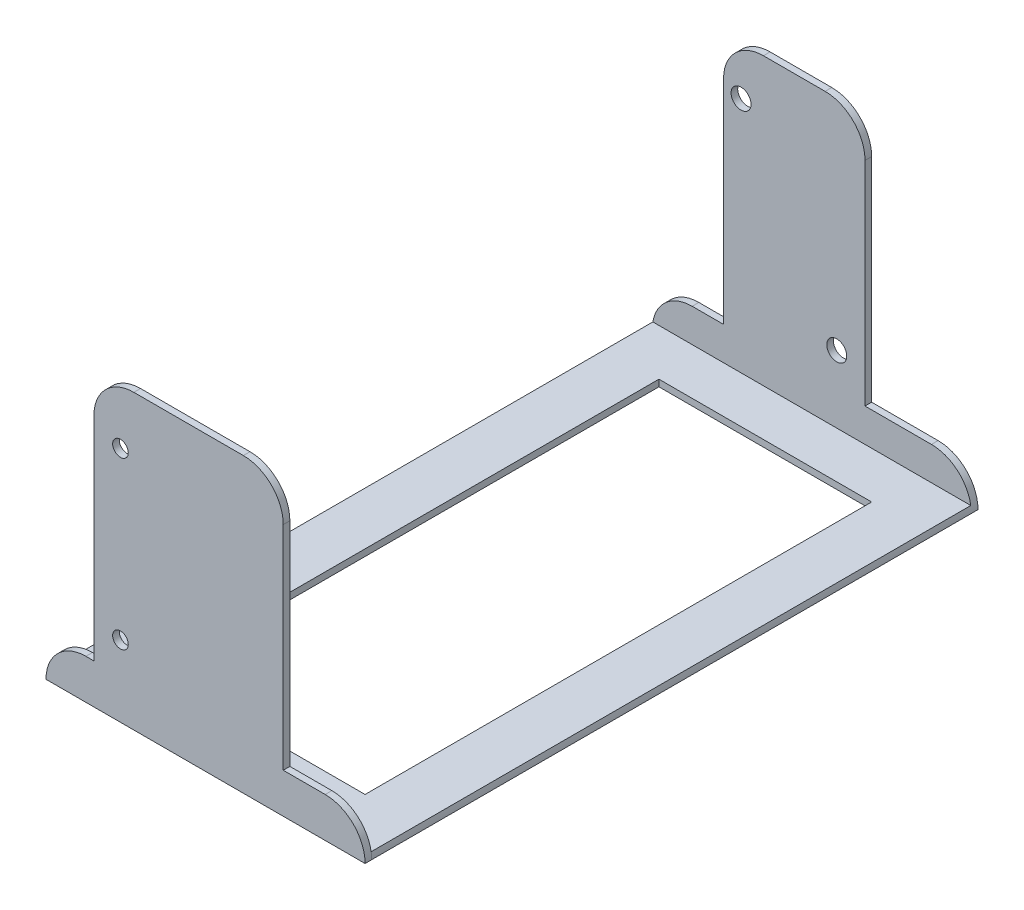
ISO-10303-21;
HEADER;
FILE_DESCRIPTION(('STEP AP214'),'2;1');
FILE_NAME('part.step','',(''),(''),'','','');
FILE_SCHEMA(('AUTOMOTIVE_DESIGN { 1 0 10303 214 1 1 1 1 }'));
ENDSEC;
DATA;
#1=APPLICATION_CONTEXT('core data for automotive mechanical design processes');
#2=APPLICATION_PROTOCOL_DEFINITION('international standard','automotive_design',2000,#1);
#3=PRODUCT_CONTEXT('',#1,'mechanical');
#4=PRODUCT('Part','Part','',(#3));
#5=PRODUCT_RELATED_PRODUCT_CATEGORY('part','',(#4));
#6=PRODUCT_DEFINITION_FORMATION('','',#4);
#7=PRODUCT_DEFINITION_CONTEXT('part definition',#1,'design');
#8=PRODUCT_DEFINITION('design','',#6,#7);
#9=PRODUCT_DEFINITION_SHAPE('','',#8);
#10=(LENGTH_UNIT() NAMED_UNIT(*) SI_UNIT(.MILLI.,.METRE.));
#11=(NAMED_UNIT(*) PLANE_ANGLE_UNIT() SI_UNIT($,.RADIAN.));
#12=(NAMED_UNIT(*) SI_UNIT($,.STERADIAN.) SOLID_ANGLE_UNIT());
#13=UNCERTAINTY_MEASURE_WITH_UNIT(LENGTH_MEASURE(1.E-05),#10,'distance_accuracy_value','');
#14=(GEOMETRIC_REPRESENTATION_CONTEXT(3) GLOBAL_UNCERTAINTY_ASSIGNED_CONTEXT((#13)) GLOBAL_UNIT_ASSIGNED_CONTEXT((#10,
#11,#12)) REPRESENTATION_CONTEXT('',''));
#15=CARTESIAN_POINT('',(0.,0.,0.));
#16=DIRECTION('',(0.,0.,1.));
#17=DIRECTION('',(1.,0.,0.));
#18=AXIS2_PLACEMENT_3D('',#15,#16,#17);
#19=CARTESIAN_POINT('',(76.2,0.,-146.3802));
#20=DIRECTION('',(0.,1.,0.));
#21=DIRECTION('',(0.,0.,1.));
#22=AXIS2_PLACEMENT_3D('',#19,#20,#21);
#23=PLANE('',#22);
#24=DIRECTION('',(1.,0.,0.));
#25=VECTOR('',#24,1.);
#26=CARTESIAN_POINT('',(12.7,0.,-133.6802));
#27=LINE('',#26,#25);
#28=CARTESIAN_POINT('',(12.7,0.,-133.6802));
#29=VERTEX_POINT('',#28);
#30=CARTESIAN_POINT('',(63.5,0.,-133.6802));
#31=VERTEX_POINT('',#30);
#32=EDGE_CURVE('E281',#29,#31,#27,.T.);
#33=ORIENTED_EDGE('',*,*,#32,.F.);
#34=DIRECTION('',(0.,0.,-1.));
#35=VECTOR('',#34,1.);
#36=CARTESIAN_POINT('',(12.7,0.,-12.7));
#37=LINE('',#36,#35);
#38=CARTESIAN_POINT('',(12.7,0.,-12.7));
#39=VERTEX_POINT('',#38);
#40=EDGE_CURVE('E279',#39,#29,#37,.T.);
#41=ORIENTED_EDGE('',*,*,#40,.F.);
#42=DIRECTION('',(-1.,0.,0.));
#43=VECTOR('',#42,1.);
#44=CARTESIAN_POINT('',(12.7,0.,-12.7));
#45=LINE('',#44,#43);
#46=CARTESIAN_POINT('',(63.5,0.,-12.7));
#47=VERTEX_POINT('',#46);
#48=EDGE_CURVE('E287',#47,#39,#45,.T.);
#49=ORIENTED_EDGE('',*,*,#48,.F.);
#50=DIRECTION('',(0.,0.,1.));
#51=VECTOR('',#50,1.);
#52=CARTESIAN_POINT('',(63.5,0.,-12.7));
#53=LINE('',#52,#51);
#54=EDGE_CURVE('E284',#31,#47,#53,.T.);
#55=ORIENTED_EDGE('',*,*,#54,.F.);
#56=EDGE_LOOP('',(#33,#41,#49,#55));
#57=FACE_BOUND('',#56,.T.);
#58=DIRECTION('',(0.,0.,-1.));
#59=VECTOR('',#58,1.);
#60=CARTESIAN_POINT('',(0.,0.,-146.3802));
#61=LINE('',#60,#59);
#62=CARTESIAN_POINT('',(0.,0.,0.));
#63=VERTEX_POINT('',#62);
#64=CARTESIAN_POINT('',(0.,0.,-1.58749999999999));
#65=VERTEX_POINT('',#64);
#66=EDGE_CURVE('E332',#63,#65,#61,.T.);
#67=ORIENTED_EDGE('',*,*,#66,.T.);
#68=CARTESIAN_POINT('',(0.,0.,-146.3802));
#69=VERTEX_POINT('',#68);
#70=EDGE_CURVE('E326',#65,#69,#61,.T.);
#71=ORIENTED_EDGE('',*,*,#70,.T.);
#72=DIRECTION('',(-1.,0.,0.));
#73=VECTOR('',#72,1.);
#74=CARTESIAN_POINT('',(76.2,0.,-146.3802));
#75=LINE('',#74,#73);
#76=CARTESIAN_POINT('',(76.2,0.,-146.3802));
#77=VERTEX_POINT('',#76);
#78=EDGE_CURVE('E353',#77,#69,#75,.T.);
#79=ORIENTED_EDGE('',*,*,#78,.F.);
#80=DIRECTION('',(0.,0.,-1.));
#81=VECTOR('',#80,1.);
#82=CARTESIAN_POINT('',(76.2,0.,-146.3802));
#83=LINE('',#82,#81);
#84=CARTESIAN_POINT('',(76.2,0.,-1.58749999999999));
#85=VERTEX_POINT('',#84);
#86=EDGE_CURVE('E331',#85,#77,#83,.T.);
#87=ORIENTED_EDGE('',*,*,#86,.F.);
#88=CARTESIAN_POINT('',(76.2,0.,0.));
#89=VERTEX_POINT('',#88);
#90=EDGE_CURVE('E327',#89,#85,#83,.T.);
#91=ORIENTED_EDGE('',*,*,#90,.F.);
#92=DIRECTION('',(-1.,0.,0.));
#93=VECTOR('',#92,1.);
#94=CARTESIAN_POINT('',(76.2,0.,0.));
#95=LINE('',#94,#93);
#96=EDGE_CURVE('E330',#89,#63,#95,.T.);
#97=ORIENTED_EDGE('',*,*,#96,.T.);
#98=EDGE_LOOP('',(#67,#71,#79,#87,#91,#97));
#99=FACE_BOUND('',#98,.T.);
#100=ADVANCED_FACE('F37',(#57,#99),#23,.F.);
#101=CARTESIAN_POINT('',(76.2,69.85,-146.3802));
#102=DIRECTION('',(0.,0.,1.));
#103=DIRECTION('',(0.,-1.,0.));
#104=AXIS2_PLACEMENT_3D('',#101,#102,#103);
#105=PLANE('',#104);
#106=CARTESIAN_POINT('',(21.1963,58.3057,-146.3802));
#107=DIRECTION('',(0.,0.,1.));
#108=DIRECTION('',(0.,-1.,0.));
#109=AXIS2_PLACEMENT_3D('',#106,#107,#108);
#110=CIRCLE('',#109,2.38125);
#111=CARTESIAN_POINT('',(21.1963,55.92445,-146.3802));
#112=VERTEX_POINT('',#111);
#113=EDGE_CURVE('E305',#112,#112,#110,.F.);
#114=ORIENTED_EDGE('',*,*,#113,.F.);
#115=EDGE_LOOP('',(#114));
#116=FACE_BOUND('',#115,.T.);
#117=CARTESIAN_POINT('',(44.0563,17.6657,-146.3802));
#118=DIRECTION('',(0.,0.,1.));
#119=DIRECTION('',(0.,-1.,0.));
#120=AXIS2_PLACEMENT_3D('',#117,#118,#119);
#121=CIRCLE('',#120,2.38125);
#122=CARTESIAN_POINT('',(44.0563,15.28445,-146.3802));
#123=VERTEX_POINT('',#122);
#124=EDGE_CURVE('E311',#123,#123,#121,.F.);
#125=ORIENTED_EDGE('',*,*,#124,.F.);
#126=EDGE_LOOP('',(#125));
#127=FACE_BOUND('',#126,.T.);
#128=ORIENTED_EDGE('',*,*,#78,.T.);
#129=CARTESIAN_POINT('',(9.525,0.,-146.3802));
#130=DIRECTION('',(0.,0.,1.));
#131=DIRECTION('',(0.,-1.,0.));
#132=AXIS2_PLACEMENT_3D('',#129,#130,#131);
#133=CIRCLE('',#132,9.525);
#134=CARTESIAN_POINT('',(9.525,9.52500000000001,-146.3802));
#135=VERTEX_POINT('',#134);
#136=EDGE_CURVE('E362',#69,#135,#133,.F.);
#137=ORIENTED_EDGE('',*,*,#136,.T.);
#138=DIRECTION('',(-1.,0.,0.));
#139=VECTOR('',#138,1.);
#140=CARTESIAN_POINT('',(0.,9.52500000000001,-146.3802));
#141=LINE('',#140,#139);
#142=CARTESIAN_POINT('',(17.018,9.52500000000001,-146.3802));
#143=VERTEX_POINT('',#142);
#144=EDGE_CURVE('E249',#143,#135,#141,.T.);
#145=ORIENTED_EDGE('',*,*,#144,.F.);
#146=DIRECTION('',(0.,-1.,0.));
#147=VECTOR('',#146,1.);
#148=CARTESIAN_POINT('',(17.018,69.85,-146.3802));
#149=LINE('',#148,#147);
#150=CARTESIAN_POINT('',(17.018,60.325,-146.3802));
#151=VERTEX_POINT('',#150);
#152=EDGE_CURVE('E252',#151,#143,#149,.T.);
#153=ORIENTED_EDGE('',*,*,#152,.F.);
#154=CARTESIAN_POINT('',(26.543,60.325,-146.3802));
#155=DIRECTION('',(0.,0.,1.));
#156=DIRECTION('',(0.,-1.,0.));
#157=AXIS2_PLACEMENT_3D('',#154,#155,#156);
#158=CIRCLE('',#157,9.525);
#159=CARTESIAN_POINT('',(26.543,69.85,-146.3802));
#160=VERTEX_POINT('',#159);
#161=EDGE_CURVE('E360',#151,#160,#158,.F.);
#162=ORIENTED_EDGE('',*,*,#161,.T.);
#163=DIRECTION('',(-1.,0.,0.));
#164=VECTOR('',#163,1.);
#165=CARTESIAN_POINT('',(76.2,69.85,-146.3802));
#166=LINE('',#165,#164);
#167=CARTESIAN_POINT('',(41.275,69.85,-146.3802));
#168=VERTEX_POINT('',#167);
#169=EDGE_CURVE('E350',#168,#160,#166,.T.);
#170=ORIENTED_EDGE('',*,*,#169,.F.);
#171=CARTESIAN_POINT('',(41.275,60.325,-146.3802));
#172=DIRECTION('',(0.,0.,1.));
#173=DIRECTION('',(0.,-1.,0.));
#174=AXIS2_PLACEMENT_3D('',#171,#172,#173);
#175=CIRCLE('',#174,9.525);
#176=CARTESIAN_POINT('',(50.8,60.325,-146.3802));
#177=VERTEX_POINT('',#176);
#178=EDGE_CURVE('E358',#168,#177,#175,.F.);
#179=ORIENTED_EDGE('',*,*,#178,.T.);
#180=DIRECTION('',(0.,1.,0.));
#181=VECTOR('',#180,1.);
#182=CARTESIAN_POINT('',(50.8,69.85,-146.3802));
#183=LINE('',#182,#181);
#184=CARTESIAN_POINT('',(50.8,9.52500000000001,-146.3802));
#185=VERTEX_POINT('',#184);
#186=EDGE_CURVE('E262',#185,#177,#183,.T.);
#187=ORIENTED_EDGE('',*,*,#186,.F.);
#188=DIRECTION('',(-1.,0.,0.));
#189=VECTOR('',#188,1.);
#190=CARTESIAN_POINT('',(76.2,9.52500000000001,-146.3802));
#191=LINE('',#190,#189);
#192=CARTESIAN_POINT('',(66.675,9.52500000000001,-146.3802));
#193=VERTEX_POINT('',#192);
#194=EDGE_CURVE('E259',#193,#185,#191,.T.);
#195=ORIENTED_EDGE('',*,*,#194,.F.);
#196=CARTESIAN_POINT('',(66.675,0.,-146.3802));
#197=DIRECTION('',(0.,0.,1.));
#198=DIRECTION('',(0.,-1.,0.));
#199=AXIS2_PLACEMENT_3D('',#196,#197,#198);
#200=CIRCLE('',#199,9.525);
#201=EDGE_CURVE('E356',#193,#77,#200,.F.);
#202=ORIENTED_EDGE('',*,*,#201,.T.);
#203=EDGE_LOOP('',(#128,#137,#145,#153,#162,#170,#179,#187,#195,#202));
#204=FACE_BOUND('',#203,.T.);
#205=ADVANCED_FACE('F468',(#116,#127,#204),#105,.F.);
#206=CARTESIAN_POINT('',(76.2,69.85,-144.7927));
#207=DIRECTION('',(0.,-1.,0.));
#208=DIRECTION('',(0.,0.,-1.));
#209=AXIS2_PLACEMENT_3D('',#206,#207,#208);
#210=PLANE('',#209);
#211=ORIENTED_EDGE('',*,*,#169,.T.);
#212=DIRECTION('',(0.,0.,-1.));
#213=VECTOR('',#212,1.);
#214=CARTESIAN_POINT('',(26.543,69.85,-144.7927));
#215=LINE('',#214,#213);
#216=CARTESIAN_POINT('',(26.543,69.85,-144.7927));
#217=VERTEX_POINT('',#216);
#218=EDGE_CURVE('E384',#160,#217,#215,.F.);
#219=ORIENTED_EDGE('',*,*,#218,.T.);
#220=DIRECTION('',(-1.,0.,0.));
#221=VECTOR('',#220,1.);
#222=CARTESIAN_POINT('',(76.2,69.85,-144.7927));
#223=LINE('',#222,#221);
#224=CARTESIAN_POINT('',(41.275,69.85,-144.7927));
#225=VERTEX_POINT('',#224);
#226=EDGE_CURVE('E347',#225,#217,#223,.T.);
#227=ORIENTED_EDGE('',*,*,#226,.F.);
#228=DIRECTION('',(0.,0.,-1.));
#229=VECTOR('',#228,1.);
#230=CARTESIAN_POINT('',(41.275,69.85,-144.7927));
#231=LINE('',#230,#229);
#232=EDGE_CURVE('E381',#225,#168,#231,.T.);
#233=ORIENTED_EDGE('',*,*,#232,.T.);
#234=EDGE_LOOP('',(#211,#219,#227,#233));
#235=FACE_BOUND('',#234,.T.);
#236=ADVANCED_FACE('F476',(#235),#210,.F.);
#237=CARTESIAN_POINT('',(76.2,1.58749999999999,-144.7927));
#238=DIRECTION('',(0.,0.,-1.));
#239=DIRECTION('',(0.,1.,0.));
#240=AXIS2_PLACEMENT_3D('',#237,#238,#239);
#241=PLANE('',#240);
#242=CARTESIAN_POINT('',(21.1963,58.3057,-144.7927));
#243=DIRECTION('',(0.,0.,1.));
#244=DIRECTION('',(1.,0.,0.));
#245=AXIS2_PLACEMENT_3D('',#242,#243,#244);
#246=CIRCLE('',#245,2.38125);
#247=CARTESIAN_POINT('',(23.57755,58.3057,-144.7927));
#248=VERTEX_POINT('',#247);
#249=EDGE_CURVE('E302',#248,#248,#246,.T.);
#250=ORIENTED_EDGE('',*,*,#249,.F.);
#251=EDGE_LOOP('',(#250));
#252=FACE_BOUND('',#251,.T.);
#253=CARTESIAN_POINT('',(44.0563,17.6657,-144.7927));
#254=DIRECTION('',(0.,0.,1.));
#255=DIRECTION('',(1.,0.,0.));
#256=AXIS2_PLACEMENT_3D('',#253,#254,#255);
#257=CIRCLE('',#256,2.38125);
#258=CARTESIAN_POINT('',(46.43755,17.6657,-144.7927));
#259=VERTEX_POINT('',#258);
#260=EDGE_CURVE('E308',#259,#259,#257,.T.);
#261=ORIENTED_EDGE('',*,*,#260,.F.);
#262=EDGE_LOOP('',(#261));
#263=FACE_BOUND('',#262,.T.);
#264=DIRECTION('',(1.,0.,0.));
#265=VECTOR('',#264,1.);
#266=CARTESIAN_POINT('',(0.,9.52500000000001,-144.7927));
#267=LINE('',#266,#265);
#268=CARTESIAN_POINT('',(9.525,9.52500000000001,-144.7927));
#269=VERTEX_POINT('',#268);
#270=CARTESIAN_POINT('',(17.018,9.52500000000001,-144.7927));
#271=VERTEX_POINT('',#270);
#272=EDGE_CURVE('E246',#269,#271,#267,.T.);
#273=ORIENTED_EDGE('',*,*,#272,.F.);
#274=CARTESIAN_POINT('',(9.525,0.,-144.7927));
#275=DIRECTION('',(0.,0.,-1.));
#276=DIRECTION('',(0.,1.,0.));
#277=AXIS2_PLACEMENT_3D('',#274,#275,#276);
#278=CIRCLE('',#277,9.525);
#279=CARTESIAN_POINT('',(0.1332233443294,1.58749999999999,-144.7927));
#280=VERTEX_POINT('',#279);
#281=EDGE_CURVE('E372',#269,#280,#278,.F.);
#282=ORIENTED_EDGE('',*,*,#281,.T.);
#283=DIRECTION('',(-1.,0.,0.));
#284=VECTOR('',#283,1.);
#285=CARTESIAN_POINT('',(76.2,1.58749999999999,-144.7927));
#286=LINE('',#285,#284);
#287=CARTESIAN_POINT('',(76.0667766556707,1.58749999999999,-144.7927));
#288=VERTEX_POINT('',#287);
#289=EDGE_CURVE('E344',#288,#280,#286,.T.);
#290=ORIENTED_EDGE('',*,*,#289,.F.);
#291=CARTESIAN_POINT('',(66.675,0.,-144.7927));
#292=DIRECTION('',(0.,0.,-1.));
#293=DIRECTION('',(0.,1.,0.));
#294=AXIS2_PLACEMENT_3D('',#291,#292,#293);
#295=CIRCLE('',#294,9.525);
#296=CARTESIAN_POINT('',(66.675,9.52500000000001,-144.7927));
#297=VERTEX_POINT('',#296);
#298=EDGE_CURVE('E366',#288,#297,#295,.F.);
#299=ORIENTED_EDGE('',*,*,#298,.T.);
#300=DIRECTION('',(1.,0.,0.));
#301=VECTOR('',#300,1.);
#302=CARTESIAN_POINT('',(76.2,9.52500000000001,-144.7927));
#303=LINE('',#302,#301);
#304=CARTESIAN_POINT('',(50.8,9.52500000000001,-144.7927));
#305=VERTEX_POINT('',#304);
#306=EDGE_CURVE('E266',#305,#297,#303,.T.);
#307=ORIENTED_EDGE('',*,*,#306,.F.);
#308=DIRECTION('',(0.,-1.,0.));
#309=VECTOR('',#308,1.);
#310=CARTESIAN_POINT('',(50.8,69.8499999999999,-144.7927));
#311=LINE('',#310,#309);
#312=CARTESIAN_POINT('',(50.8,60.325,-144.7927));
#313=VERTEX_POINT('',#312);
#314=EDGE_CURVE('E261',#313,#305,#311,.T.);
#315=ORIENTED_EDGE('',*,*,#314,.F.);
#316=CARTESIAN_POINT('',(41.275,60.325,-144.7927));
#317=DIRECTION('',(0.,0.,-1.));
#318=DIRECTION('',(0.,1.,0.));
#319=AXIS2_PLACEMENT_3D('',#316,#317,#318);
#320=CIRCLE('',#319,9.525);
#321=EDGE_CURVE('E368',#313,#225,#320,.F.);
#322=ORIENTED_EDGE('',*,*,#321,.T.);
#323=ORIENTED_EDGE('',*,*,#226,.T.);
#324=CARTESIAN_POINT('',(26.543,60.325,-144.7927));
#325=DIRECTION('',(0.,0.,-1.));
#326=DIRECTION('',(0.,1.,0.));
#327=AXIS2_PLACEMENT_3D('',#324,#325,#326);
#328=CIRCLE('',#327,9.525);
#329=CARTESIAN_POINT('',(17.018,60.325,-144.7927));
#330=VERTEX_POINT('',#329);
#331=EDGE_CURVE('E370',#217,#330,#328,.F.);
#332=ORIENTED_EDGE('',*,*,#331,.T.);
#333=DIRECTION('',(0.,1.,0.));
#334=VECTOR('',#333,1.);
#335=CARTESIAN_POINT('',(17.018,69.8499999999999,-144.7927));
#336=LINE('',#335,#334);
#337=EDGE_CURVE('E248',#271,#330,#336,.T.);
#338=ORIENTED_EDGE('',*,*,#337,.F.);
#339=EDGE_LOOP('',(#273,#282,#290,#299,#307,#315,#322,#323,#332,#338));
#340=FACE_BOUND('',#339,.T.);
#341=ADVANCED_FACE('F457',(#252,#263,#340),#241,.F.);
#342=CARTESIAN_POINT('',(76.2,1.58749999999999,-1.5875));
#343=DIRECTION('',(0.,-1.,0.));
#344=DIRECTION('',(0.,0.,-1.));
#345=AXIS2_PLACEMENT_3D('',#342,#343,#344);
#346=PLANE('',#345);
#347=DIRECTION('',(1.,0.,0.));
#348=VECTOR('',#347,1.);
#349=CARTESIAN_POINT('',(12.7,1.58749999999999,-12.7));
#350=LINE('',#349,#348);
#351=CARTESIAN_POINT('',(12.7,1.58749999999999,-12.7));
#352=VERTEX_POINT('',#351);
#353=CARTESIAN_POINT('',(63.5,1.58749999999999,-12.7));
#354=VERTEX_POINT('',#353);
#355=EDGE_CURVE('E273',#352,#354,#350,.T.);
#356=ORIENTED_EDGE('',*,*,#355,.F.);
#357=DIRECTION('',(0.,0.,1.));
#358=VECTOR('',#357,1.);
#359=CARTESIAN_POINT('',(12.7,1.58749999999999,-12.7));
#360=LINE('',#359,#358);
#361=CARTESIAN_POINT('',(12.7,1.58749999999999,-133.6802));
#362=VERTEX_POINT('',#361);
#363=EDGE_CURVE('E276',#362,#352,#360,.T.);
#364=ORIENTED_EDGE('',*,*,#363,.F.);
#365=DIRECTION('',(-1.,0.,0.));
#366=VECTOR('',#365,1.);
#367=CARTESIAN_POINT('',(12.7,1.58749999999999,-133.6802));
#368=LINE('',#367,#366);
#369=CARTESIAN_POINT('',(63.5,1.58749999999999,-133.6802));
#370=VERTEX_POINT('',#369);
#371=EDGE_CURVE('E293',#370,#362,#368,.T.);
#372=ORIENTED_EDGE('',*,*,#371,.F.);
#373=DIRECTION('',(0.,0.,-1.));
#374=VECTOR('',#373,1.);
#375=CARTESIAN_POINT('',(63.5,1.58749999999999,-12.7));
#376=LINE('',#375,#374);
#377=EDGE_CURVE('E269',#354,#370,#376,.T.);
#378=ORIENTED_EDGE('',*,*,#377,.F.);
#379=EDGE_LOOP('',(#356,#364,#372,#378));
#380=FACE_BOUND('',#379,.T.);
#381=ORIENTED_EDGE('',*,*,#289,.T.);
#382=DIRECTION('',(0.,0.,1.));
#383=VECTOR('',#382,1.);
#384=CARTESIAN_POINT('',(0.133223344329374,1.58749999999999,-144.7927));
#385=LINE('',#384,#383);
#386=CARTESIAN_POINT('',(0.1332233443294,1.58749999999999,-1.5875));
#387=VERTEX_POINT('',#386);
#388=EDGE_CURVE('E376',#280,#387,#385,.T.);
#389=ORIENTED_EDGE('',*,*,#388,.T.);
#390=DIRECTION('',(-1.,0.,0.));
#391=VECTOR('',#390,1.);
#392=CARTESIAN_POINT('',(76.2,1.58749999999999,-1.5875));
#393=LINE('',#392,#391);
#394=CARTESIAN_POINT('',(76.0667766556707,1.58749999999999,-1.5875));
#395=VERTEX_POINT('',#394);
#396=EDGE_CURVE('E342',#395,#387,#393,.T.);
#397=ORIENTED_EDGE('',*,*,#396,.F.);
#398=DIRECTION('',(0.,0.,-1.));
#399=VECTOR('',#398,1.);
#400=CARTESIAN_POINT('',(76.0667766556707,1.58749999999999,-1.5875));
#401=LINE('',#400,#399);
#402=EDGE_CURVE('E374',#395,#288,#401,.T.);
#403=ORIENTED_EDGE('',*,*,#402,.T.);
#404=EDGE_LOOP('',(#381,#389,#397,#403));
#405=FACE_BOUND('',#404,.T.);
#406=ADVANCED_FACE('F446',(#380,#405),#346,.F.);
#407=CARTESIAN_POINT('',(76.2,69.85,-1.5875));
#408=DIRECTION('',(0.,0.,1.));
#409=DIRECTION('',(0.,-1.,0.));
#410=AXIS2_PLACEMENT_3D('',#407,#408,#409);
#411=PLANE('',#410);
#412=CARTESIAN_POINT('',(17.78,56.6674,-1.58749999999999));
#413=DIRECTION('',(0.,0.,1.));
#414=DIRECTION('',(0.,-1.,0.));
#415=AXIS2_PLACEMENT_3D('',#412,#413,#414);
#416=CIRCLE('',#415,1.8669);
#417=CARTESIAN_POINT('',(17.78,54.8005,-1.58749999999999));
#418=VERTEX_POINT('',#417);
#419=EDGE_CURVE('E314',#418,#418,#416,.F.);
#420=ORIENTED_EDGE('',*,*,#419,.F.);
#421=EDGE_LOOP('',(#420));
#422=FACE_BOUND('',#421,.T.);
#423=CARTESIAN_POINT('',(17.78,17.0434,-1.58749999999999));
#424=DIRECTION('',(0.,0.,1.));
#425=DIRECTION('',(0.,-1.,0.));
#426=AXIS2_PLACEMENT_3D('',#423,#424,#425);
#427=CIRCLE('',#426,1.8669);
#428=CARTESIAN_POINT('',(17.78,15.1765,-1.58749999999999));
#429=VERTEX_POINT('',#428);
#430=EDGE_CURVE('E320',#429,#429,#427,.F.);
#431=ORIENTED_EDGE('',*,*,#430,.F.);
#432=EDGE_LOOP('',(#431));
#433=FACE_BOUND('',#432,.T.);
#434=DIRECTION('',(-1.,0.,0.));
#435=VECTOR('',#434,1.);
#436=CARTESIAN_POINT('',(76.2,69.85,-1.5875));
#437=LINE('',#436,#435);
#438=CARTESIAN_POINT('',(47.1297,69.85,-1.5875));
#439=VERTEX_POINT('',#438);
#440=CARTESIAN_POINT('',(20.9804,69.85,-1.5875));
#441=VERTEX_POINT('',#440);
#442=EDGE_CURVE('E339',#439,#441,#437,.T.);
#443=ORIENTED_EDGE('',*,*,#442,.F.);
#444=CARTESIAN_POINT('',(47.1297,60.325,-1.58749999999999));
#445=DIRECTION('',(0.,0.,1.));
#446=DIRECTION('',(0.,-1.,0.));
#447=AXIS2_PLACEMENT_3D('',#444,#445,#446);
#448=CIRCLE('',#447,9.525);
#449=CARTESIAN_POINT('',(56.6547,60.325,-1.58749999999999));
#450=VERTEX_POINT('',#449);
#451=EDGE_CURVE('E230',#439,#450,#448,.F.);
#452=ORIENTED_EDGE('',*,*,#451,.T.);
#453=DIRECTION('',(0.,1.,0.));
#454=VECTOR('',#453,1.);
#455=CARTESIAN_POINT('',(56.6547,69.85,-1.58749999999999));
#456=LINE('',#455,#454);
#457=CARTESIAN_POINT('',(56.6547,9.525,-1.58749999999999));
#458=VERTEX_POINT('',#457);
#459=EDGE_CURVE('E221',#458,#450,#456,.T.);
#460=ORIENTED_EDGE('',*,*,#459,.F.);
#461=DIRECTION('',(-1.,0.,0.));
#462=VECTOR('',#461,1.);
#463=CARTESIAN_POINT('',(76.2,9.525,-1.58749999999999));
#464=LINE('',#463,#462);
#465=CARTESIAN_POINT('',(66.675,9.525,-1.58749999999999));
#466=VERTEX_POINT('',#465);
#467=EDGE_CURVE('E206',#466,#458,#464,.T.);
#468=ORIENTED_EDGE('',*,*,#467,.F.);
#469=CARTESIAN_POINT('',(66.675,0.,-1.5875));
#470=DIRECTION('',(0.,0.,1.));
#471=DIRECTION('',(0.,-1.,0.));
#472=AXIS2_PLACEMENT_3D('',#469,#470,#471);
#473=CIRCLE('',#472,9.525);
#474=EDGE_CURVE('E412',#466,#395,#473,.F.);
#475=ORIENTED_EDGE('',*,*,#474,.T.);
#476=ORIENTED_EDGE('',*,*,#396,.T.);
#477=CARTESIAN_POINT('',(9.525,0.,-1.58749999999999));
#478=DIRECTION('',(0.,0.,1.));
#479=DIRECTION('',(0.,-1.,0.));
#480=AXIS2_PLACEMENT_3D('',#477,#478,#479);
#481=CIRCLE('',#480,9.525);
#482=CARTESIAN_POINT('',(9.525,9.525,-1.58749999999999));
#483=VERTEX_POINT('',#482);
#484=EDGE_CURVE('E60',#387,#483,#481,.F.);
#485=ORIENTED_EDGE('',*,*,#484,.T.);
#486=DIRECTION('',(-1.,0.,0.));
#487=VECTOR('',#486,1.);
#488=CARTESIAN_POINT('',(0.,9.525,-1.58749999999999));
#489=LINE('',#488,#487);
#490=CARTESIAN_POINT('',(11.4554,9.525,-1.58749999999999));
#491=VERTEX_POINT('',#490);
#492=EDGE_CURVE('E215',#491,#483,#489,.T.);
#493=ORIENTED_EDGE('',*,*,#492,.F.);
#494=DIRECTION('',(0.,-1.,0.));
#495=VECTOR('',#494,1.);
#496=CARTESIAN_POINT('',(11.4554,69.85,-1.58749999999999));
#497=LINE('',#496,#495);
#498=CARTESIAN_POINT('',(11.4554,60.325,-1.58749999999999));
#499=VERTEX_POINT('',#498);
#500=EDGE_CURVE('E236',#499,#491,#497,.T.);
#501=ORIENTED_EDGE('',*,*,#500,.F.);
#502=CARTESIAN_POINT('',(20.9804,60.325,-1.5875));
#503=DIRECTION('',(0.,0.,1.));
#504=DIRECTION('',(0.,-1.,0.));
#505=AXIS2_PLACEMENT_3D('',#502,#503,#504);
#506=CIRCLE('',#505,9.525);
#507=EDGE_CURVE('E415',#499,#441,#506,.F.);
#508=ORIENTED_EDGE('',*,*,#507,.T.);
#509=EDGE_LOOP('',(#443,#452,#460,#468,#475,#476,#485,#493,#501,#508));
#510=FACE_BOUND('',#509,.T.);
#511=ADVANCED_FACE('F228',(#422,#433,#510),#411,.F.);
#512=CARTESIAN_POINT('',(76.2,69.85,0.));
#513=DIRECTION('',(0.,-1.,0.));
#514=DIRECTION('',(0.,0.,-1.));
#515=AXIS2_PLACEMENT_3D('',#512,#513,#514);
#516=PLANE('',#515);
#517=DIRECTION('',(-1.,0.,0.));
#518=VECTOR('',#517,1.);
#519=CARTESIAN_POINT('',(76.2,69.85,0.));
#520=LINE('',#519,#518);
#521=CARTESIAN_POINT('',(47.1297,69.85,0.));
#522=VERTEX_POINT('',#521);
#523=CARTESIAN_POINT('',(20.9804,69.85,0.));
#524=VERTEX_POINT('',#523);
#525=EDGE_CURVE('E336',#522,#524,#520,.T.);
#526=ORIENTED_EDGE('',*,*,#525,.F.);
#527=DIRECTION('',(0.,0.,1.));
#528=VECTOR('',#527,1.);
#529=CARTESIAN_POINT('',(47.1297,69.85,0.));
#530=LINE('',#529,#528);
#531=EDGE_CURVE('E410',#522,#439,#530,.F.);
#532=ORIENTED_EDGE('',*,*,#531,.T.);
#533=ORIENTED_EDGE('',*,*,#442,.T.);
#534=DIRECTION('',(0.,0.,1.));
#535=VECTOR('',#534,1.);
#536=CARTESIAN_POINT('',(20.9804,69.85,0.));
#537=LINE('',#536,#535);
#538=EDGE_CURVE('E407',#441,#524,#537,.T.);
#539=ORIENTED_EDGE('',*,*,#538,.T.);
#540=EDGE_LOOP('',(#526,#532,#533,#539));
#541=FACE_BOUND('',#540,.T.);
#542=ADVANCED_FACE('F436',(#541),#516,.F.);
#543=CARTESIAN_POINT('',(76.2,0.,0.));
#544=DIRECTION('',(0.,0.,-1.));
#545=DIRECTION('',(-1.,0.,0.));
#546=AXIS2_PLACEMENT_3D('',#543,#544,#545);
#547=PLANE('',#546);
#548=CARTESIAN_POINT('',(17.78,56.6674,0.));
#549=DIRECTION('',(0.,0.,1.));
#550=DIRECTION('',(1.,0.,0.));
#551=AXIS2_PLACEMENT_3D('',#548,#549,#550);
#552=CIRCLE('',#551,1.8669);
#553=CARTESIAN_POINT('',(19.6469,56.6674,0.));
#554=VERTEX_POINT('',#553);
#555=EDGE_CURVE('E317',#554,#554,#552,.T.);
#556=ORIENTED_EDGE('',*,*,#555,.F.);
#557=EDGE_LOOP('',(#556));
#558=FACE_BOUND('',#557,.T.);
#559=CARTESIAN_POINT('',(17.78,17.0434,0.));
#560=DIRECTION('',(0.,0.,1.));
#561=DIRECTION('',(1.,0.,0.));
#562=AXIS2_PLACEMENT_3D('',#559,#560,#561);
#563=CIRCLE('',#562,1.8669);
#564=CARTESIAN_POINT('',(19.6469,17.0434,0.));
#565=VERTEX_POINT('',#564);
#566=EDGE_CURVE('E323',#565,#565,#563,.T.);
#567=ORIENTED_EDGE('',*,*,#566,.F.);
#568=EDGE_LOOP('',(#567));
#569=FACE_BOUND('',#568,.T.);
#570=DIRECTION('',(0.,-1.,0.));
#571=VECTOR('',#570,1.);
#572=CARTESIAN_POINT('',(56.6547,69.85,0.));
#573=LINE('',#572,#571);
#574=CARTESIAN_POINT('',(56.6547,60.325,0.));
#575=VERTEX_POINT('',#574);
#576=CARTESIAN_POINT('',(56.6547,9.525,0.));
#577=VERTEX_POINT('',#576);
#578=EDGE_CURVE('E224',#575,#577,#573,.T.);
#579=ORIENTED_EDGE('',*,*,#578,.F.);
#580=CARTESIAN_POINT('',(47.1297,60.325,0.));
#581=DIRECTION('',(0.,0.,-1.));
#582=DIRECTION('',(-1.,0.,0.));
#583=AXIS2_PLACEMENT_3D('',#580,#581,#582);
#584=CIRCLE('',#583,9.525);
#585=EDGE_CURVE('E405',#575,#522,#584,.F.);
#586=ORIENTED_EDGE('',*,*,#585,.T.);
#587=ORIENTED_EDGE('',*,*,#525,.T.);
#588=CARTESIAN_POINT('',(20.9804,60.325,0.));
#589=DIRECTION('',(0.,0.,-1.));
#590=DIRECTION('',(-1.,0.,0.));
#591=AXIS2_PLACEMENT_3D('',#588,#589,#590);
#592=CIRCLE('',#591,9.525);
#593=CARTESIAN_POINT('',(11.4554,60.325,0.));
#594=VERTEX_POINT('',#593);
#595=EDGE_CURVE('E403',#524,#594,#592,.F.);
#596=ORIENTED_EDGE('',*,*,#595,.T.);
#597=DIRECTION('',(0.,1.,0.));
#598=VECTOR('',#597,1.);
#599=CARTESIAN_POINT('',(11.4554,69.85,0.));
#600=LINE('',#599,#598);
#601=CARTESIAN_POINT('',(11.4554,9.525,0.));
#602=VERTEX_POINT('',#601);
#603=EDGE_CURVE('E238',#602,#594,#600,.T.);
#604=ORIENTED_EDGE('',*,*,#603,.F.);
#605=DIRECTION('',(1.,0.,0.));
#606=VECTOR('',#605,1.);
#607=CARTESIAN_POINT('',(0.,9.525,0.));
#608=LINE('',#607,#606);
#609=CARTESIAN_POINT('',(9.525,9.525,0.));
#610=VERTEX_POINT('',#609);
#611=EDGE_CURVE('E240',#610,#602,#608,.T.);
#612=ORIENTED_EDGE('',*,*,#611,.F.);
#613=CARTESIAN_POINT('',(9.525,0.,0.));
#614=DIRECTION('',(0.,0.,-1.));
#615=DIRECTION('',(-1.,0.,0.));
#616=AXIS2_PLACEMENT_3D('',#613,#614,#615);
#617=CIRCLE('',#616,9.525);
#618=EDGE_CURVE('E401',#610,#63,#617,.F.);
#619=ORIENTED_EDGE('',*,*,#618,.T.);
#620=ORIENTED_EDGE('',*,*,#96,.F.);
#621=CARTESIAN_POINT('',(66.675,0.,0.));
#622=DIRECTION('',(0.,0.,-1.));
#623=DIRECTION('',(-1.,0.,0.));
#624=AXIS2_PLACEMENT_3D('',#621,#622,#623);
#625=CIRCLE('',#624,9.525);
#626=CARTESIAN_POINT('',(66.675,9.525,0.));
#627=VERTEX_POINT('',#626);
#628=EDGE_CURVE('E399',#89,#627,#625,.F.);
#629=ORIENTED_EDGE('',*,*,#628,.T.);
#630=DIRECTION('',(1.,0.,0.));
#631=VECTOR('',#630,1.);
#632=CARTESIAN_POINT('',(76.2,9.525,0.));
#633=LINE('',#632,#631);
#634=EDGE_CURVE('E225',#577,#627,#633,.T.);
#635=ORIENTED_EDGE('',*,*,#634,.F.);
#636=EDGE_LOOP('',(#579,#586,#587,#596,#604,#612,#619,#620,#629,#635));
#637=FACE_BOUND('',#636,.T.);
#638=ADVANCED_FACE('F427',(#558,#569,#637),#547,.F.);
#639=CARTESIAN_POINT('',(17.78,17.0434,-146.3812));
#640=DIRECTION('',(0.,0.,1.));
#641=DIRECTION('',(1.,0.,0.));
#642=AXIS2_PLACEMENT_3D('',#639,#640,#641);
#643=CYLINDRICAL_SURFACE('',#642,1.8669);
#644=ORIENTED_EDGE('',*,*,#566,.T.);
#645=EDGE_LOOP('',(#644));
#646=FACE_BOUND('',#645,.T.);
#647=ORIENTED_EDGE('',*,*,#430,.T.);
#648=EDGE_LOOP('',(#647));
#649=FACE_BOUND('',#648,.T.);
#650=ADVANCED_FACE('F575',(#646,#649),#643,.F.);
#651=CARTESIAN_POINT('',(17.78,56.6674,-146.3812));
#652=DIRECTION('',(0.,0.,1.));
#653=DIRECTION('',(1.,0.,0.));
#654=AXIS2_PLACEMENT_3D('',#651,#652,#653);
#655=CYLINDRICAL_SURFACE('',#654,1.8669);
#656=ORIENTED_EDGE('',*,*,#555,.T.);
#657=EDGE_LOOP('',(#656));
#658=FACE_BOUND('',#657,.T.);
#659=ORIENTED_EDGE('',*,*,#419,.T.);
#660=EDGE_LOOP('',(#659));
#661=FACE_BOUND('',#660,.T.);
#662=ADVANCED_FACE('F571',(#658,#661),#655,.F.);
#663=CARTESIAN_POINT('',(44.0563,17.6657,-146.3812));
#664=DIRECTION('',(0.,0.,1.));
#665=DIRECTION('',(1.,0.,0.));
#666=AXIS2_PLACEMENT_3D('',#663,#664,#665);
#667=CYLINDRICAL_SURFACE('',#666,2.38125);
#668=ORIENTED_EDGE('',*,*,#260,.T.);
#669=EDGE_LOOP('',(#668));
#670=FACE_BOUND('',#669,.T.);
#671=ORIENTED_EDGE('',*,*,#124,.T.);
#672=EDGE_LOOP('',(#671));
#673=FACE_BOUND('',#672,.T.);
#674=ADVANCED_FACE('F567',(#670,#673),#667,.F.);
#675=CARTESIAN_POINT('',(21.1963,58.3057,-146.3812));
#676=DIRECTION('',(0.,0.,1.));
#677=DIRECTION('',(1.,0.,0.));
#678=AXIS2_PLACEMENT_3D('',#675,#676,#677);
#679=CYLINDRICAL_SURFACE('',#678,2.38125);
#680=ORIENTED_EDGE('',*,*,#249,.T.);
#681=EDGE_LOOP('',(#680));
#682=FACE_BOUND('',#681,.T.);
#683=ORIENTED_EDGE('',*,*,#113,.T.);
#684=EDGE_LOOP('',(#683));
#685=FACE_BOUND('',#684,.T.);
#686=ADVANCED_FACE('F563',(#682,#685),#679,.F.);
#687=CARTESIAN_POINT('',(12.7,69.851,-12.7));
#688=DIRECTION('',(-1.,0.,0.));
#689=DIRECTION('',(0.,0.,1.));
#690=AXIS2_PLACEMENT_3D('',#687,#688,#689);
#691=PLANE('',#690);
#692=ORIENTED_EDGE('',*,*,#363,.T.);
#693=DIRECTION('',(0.,-1.,0.));
#694=VECTOR('',#693,1.);
#695=CARTESIAN_POINT('',(12.7,69.851,-12.7));
#696=LINE('',#695,#694);
#697=EDGE_CURVE('E291',#352,#39,#696,.T.);
#698=ORIENTED_EDGE('',*,*,#697,.T.);
#699=ORIENTED_EDGE('',*,*,#40,.T.);
#700=DIRECTION('',(0.,-1.,0.));
#701=VECTOR('',#700,1.);
#702=CARTESIAN_POINT('',(12.7,69.851,-133.6802));
#703=LINE('',#702,#701);
#704=EDGE_CURVE('E290',#362,#29,#703,.T.);
#705=ORIENTED_EDGE('',*,*,#704,.F.);
#706=EDGE_LOOP('',(#692,#698,#699,#705));
#707=FACE_BOUND('',#706,.T.);
#708=ADVANCED_FACE('F553',(#707),#691,.F.);
#709=CARTESIAN_POINT('',(12.7,69.851,-12.7));
#710=DIRECTION('',(0.,0.,1.));
#711=DIRECTION('',(0.,-1.,0.));
#712=AXIS2_PLACEMENT_3D('',#709,#710,#711);
#713=PLANE('',#712);
#714=ORIENTED_EDGE('',*,*,#355,.T.);
#715=DIRECTION('',(0.,-1.,0.));
#716=VECTOR('',#715,1.);
#717=CARTESIAN_POINT('',(63.5,69.851,-12.7));
#718=LINE('',#717,#716);
#719=EDGE_CURVE('E294',#354,#47,#718,.T.);
#720=ORIENTED_EDGE('',*,*,#719,.T.);
#721=ORIENTED_EDGE('',*,*,#48,.T.);
#722=ORIENTED_EDGE('',*,*,#697,.F.);
#723=EDGE_LOOP('',(#714,#720,#721,#722));
#724=FACE_BOUND('',#723,.T.);
#725=ADVANCED_FACE('F549',(#724),#713,.F.);
#726=CARTESIAN_POINT('',(63.5,69.851,-12.7));
#727=DIRECTION('',(1.,0.,0.));
#728=DIRECTION('',(0.,0.,-1.));
#729=AXIS2_PLACEMENT_3D('',#726,#727,#728);
#730=PLANE('',#729);
#731=ORIENTED_EDGE('',*,*,#377,.T.);
#732=DIRECTION('',(0.,-1.,0.));
#733=VECTOR('',#732,1.);
#734=CARTESIAN_POINT('',(63.5,69.851,-133.6802));
#735=LINE('',#734,#733);
#736=EDGE_CURVE('E296',#370,#31,#735,.T.);
#737=ORIENTED_EDGE('',*,*,#736,.T.);
#738=ORIENTED_EDGE('',*,*,#54,.T.);
#739=ORIENTED_EDGE('',*,*,#719,.F.);
#740=EDGE_LOOP('',(#731,#737,#738,#739));
#741=FACE_BOUND('',#740,.T.);
#742=ADVANCED_FACE('F552',(#741),#730,.F.);
#743=CARTESIAN_POINT('',(12.7,69.851,-133.6802));
#744=DIRECTION('',(0.,0.,-1.));
#745=DIRECTION('',(0.,1.,0.));
#746=AXIS2_PLACEMENT_3D('',#743,#744,#745);
#747=PLANE('',#746);
#748=ORIENTED_EDGE('',*,*,#371,.T.);
#749=ORIENTED_EDGE('',*,*,#704,.T.);
#750=ORIENTED_EDGE('',*,*,#32,.T.);
#751=ORIENTED_EDGE('',*,*,#736,.F.);
#752=EDGE_LOOP('',(#748,#749,#750,#751));
#753=FACE_BOUND('',#752,.T.);
#754=ADVANCED_FACE('F548',(#753),#747,.F.);
#755=CARTESIAN_POINT('',(50.8,69.8500000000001,0.001000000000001));
#756=DIRECTION('',(-1.,0.,0.));
#757=DIRECTION('',(0.,-1.,0.));
#758=AXIS2_PLACEMENT_3D('',#755,#756,#757);
#759=PLANE('',#758);
#760=ORIENTED_EDGE('',*,*,#186,.T.);
#761=DIRECTION('',(0.,0.,-1.));
#762=VECTOR('',#761,1.);
#763=CARTESIAN_POINT('',(50.8,60.325,0.001000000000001));
#764=LINE('',#763,#762);
#765=EDGE_CURVE('E386',#177,#313,#764,.F.);
#766=ORIENTED_EDGE('',*,*,#765,.T.);
#767=ORIENTED_EDGE('',*,*,#314,.T.);
#768=DIRECTION('',(0.,0.,-1.));
#769=VECTOR('',#768,1.);
#770=CARTESIAN_POINT('',(50.8,9.52500000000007,0.00100000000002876));
#771=LINE('',#770,#769);
#772=EDGE_CURVE('E256',#305,#185,#771,.T.);
#773=ORIENTED_EDGE('',*,*,#772,.T.);
#774=EDGE_LOOP('',(#760,#766,#767,#773));
#775=FACE_BOUND('',#774,.T.);
#776=ADVANCED_FACE('F465',(#775),#759,.F.);
#777=CARTESIAN_POINT('',(76.2,9.52500000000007,0.00100000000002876));
#778=DIRECTION('',(0.,-1.,0.));
#779=DIRECTION('',(0.,0.,-1.));
#780=AXIS2_PLACEMENT_3D('',#777,#778,#779);
#781=PLANE('',#780);
#782=ORIENTED_EDGE('',*,*,#306,.T.);
#783=DIRECTION('',(0.,0.,-1.));
#784=VECTOR('',#783,1.);
#785=CARTESIAN_POINT('',(66.675,9.52500000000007,0.00100000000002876));
#786=LINE('',#785,#784);
#787=EDGE_CURVE('E388',#297,#193,#786,.T.);
#788=ORIENTED_EDGE('',*,*,#787,.T.);
#789=ORIENTED_EDGE('',*,*,#194,.T.);
#790=ORIENTED_EDGE('',*,*,#772,.F.);
#791=EDGE_LOOP('',(#782,#788,#789,#790));
#792=FACE_BOUND('',#791,.T.);
#793=ADVANCED_FACE('F461',(#792),#781,.F.);
#794=CARTESIAN_POINT('',(17.018,69.8500000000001,0.001000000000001));
#795=DIRECTION('',(1.,0.,0.));
#796=DIRECTION('',(0.,1.,0.));
#797=AXIS2_PLACEMENT_3D('',#794,#795,#796);
#798=PLANE('',#797);
#799=ORIENTED_EDGE('',*,*,#337,.T.);
#800=DIRECTION('',(0.,0.,-1.));
#801=VECTOR('',#800,1.);
#802=CARTESIAN_POINT('',(17.018,60.325,0.001000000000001));
#803=LINE('',#802,#801);
#804=EDGE_CURVE('E378',#330,#151,#803,.T.);
#805=ORIENTED_EDGE('',*,*,#804,.T.);
#806=ORIENTED_EDGE('',*,*,#152,.T.);
#807=DIRECTION('',(0.,0.,-1.));
#808=VECTOR('',#807,1.);
#809=CARTESIAN_POINT('',(17.018,9.52500000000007,0.00100000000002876));
#810=LINE('',#809,#808);
#811=EDGE_CURVE('E245',#271,#143,#810,.T.);
#812=ORIENTED_EDGE('',*,*,#811,.F.);
#813=EDGE_LOOP('',(#799,#805,#806,#812));
#814=FACE_BOUND('',#813,.T.);
#815=ADVANCED_FACE('F485',(#814),#798,.F.);
#816=CARTESIAN_POINT('',(0.,9.52500000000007,0.00100000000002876));
#817=DIRECTION('',(0.,-1.,0.));
#818=DIRECTION('',(0.,0.,-1.));
#819=AXIS2_PLACEMENT_3D('',#816,#817,#818);
#820=PLANE('',#819);
#821=ORIENTED_EDGE('',*,*,#144,.T.);
#822=DIRECTION('',(0.,0.,-1.));
#823=VECTOR('',#822,1.);
#824=CARTESIAN_POINT('',(9.525,9.52500000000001,-144.7927));
#825=LINE('',#824,#823);
#826=EDGE_CURVE('E364',#135,#269,#825,.F.);
#827=ORIENTED_EDGE('',*,*,#826,.T.);
#828=ORIENTED_EDGE('',*,*,#272,.T.);
#829=ORIENTED_EDGE('',*,*,#811,.T.);
#830=EDGE_LOOP('',(#821,#827,#828,#829));
#831=FACE_BOUND('',#830,.T.);
#832=ADVANCED_FACE('F490',(#831),#820,.F.);
#833=CARTESIAN_POINT('',(9.525,0.,0.));
#834=DIRECTION('',(0.,0.,1.));
#835=DIRECTION('',(0.,-1.,0.));
#836=AXIS2_PLACEMENT_3D('',#833,#834,#835);
#837=CYLINDRICAL_SURFACE('',#836,9.525);
#838=ORIENTED_EDGE('',*,*,#281,.F.);
#839=ORIENTED_EDGE('',*,*,#826,.F.);
#840=ORIENTED_EDGE('',*,*,#136,.F.);
#841=ORIENTED_EDGE('',*,*,#70,.F.);
#842=CARTESIAN_POINT('',(9.525,0.,-1.5875));
#843=DIRECTION('',(0.,0.,1.));
#844=DIRECTION('',(0.,-1.,0.));
#845=AXIS2_PLACEMENT_3D('',#842,#843,#844);
#846=CIRCLE('',#845,9.525);
#847=EDGE_CURVE('E391',#387,#65,#846,.T.);
#848=ORIENTED_EDGE('',*,*,#847,.F.);
#849=ORIENTED_EDGE('',*,*,#388,.F.);
#850=EDGE_LOOP('',(#838,#839,#840,#841,#848,#849));
#851=FACE_BOUND('',#850,.T.);
#852=ADVANCED_FACE('F493',(#851),#837,.T.);
#853=CARTESIAN_POINT('',(26.543,60.325,0.001000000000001));
#854=DIRECTION('',(0.,0.,-1.));
#855=DIRECTION('',(-1.,0.,0.));
#856=AXIS2_PLACEMENT_3D('',#853,#854,#855);
#857=CYLINDRICAL_SURFACE('',#856,9.525);
#858=ORIENTED_EDGE('',*,*,#331,.F.);
#859=ORIENTED_EDGE('',*,*,#218,.F.);
#860=ORIENTED_EDGE('',*,*,#161,.F.);
#861=ORIENTED_EDGE('',*,*,#804,.F.);
#862=EDGE_LOOP('',(#858,#859,#860,#861));
#863=FACE_BOUND('',#862,.T.);
#864=ADVANCED_FACE('F482',(#863),#857,.T.);
#865=CARTESIAN_POINT('',(41.275,60.325,-144.7927));
#866=DIRECTION('',(0.,0.,-1.));
#867=DIRECTION('',(-1.,0.,0.));
#868=AXIS2_PLACEMENT_3D('',#865,#866,#867);
#869=CYLINDRICAL_SURFACE('',#868,9.525);
#870=ORIENTED_EDGE('',*,*,#321,.F.);
#871=ORIENTED_EDGE('',*,*,#765,.F.);
#872=ORIENTED_EDGE('',*,*,#178,.F.);
#873=ORIENTED_EDGE('',*,*,#232,.F.);
#874=EDGE_LOOP('',(#870,#871,#872,#873));
#875=FACE_BOUND('',#874,.T.);
#876=ADVANCED_FACE('F473',(#875),#869,.T.);
#877=CARTESIAN_POINT('',(66.675,0.,0.00100000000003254));
#878=DIRECTION('',(0.,0.,-1.));
#879=DIRECTION('',(0.,1.,0.));
#880=AXIS2_PLACEMENT_3D('',#877,#878,#879);
#881=CYLINDRICAL_SURFACE('',#880,9.525);
#882=CARTESIAN_POINT('',(66.675,0.,-1.5875));
#883=DIRECTION('',(0.,0.,1.));
#884=DIRECTION('',(0.,-1.,0.));
#885=AXIS2_PLACEMENT_3D('',#882,#883,#884);
#886=CIRCLE('',#885,9.525);
#887=EDGE_CURVE('E394',#85,#395,#886,.T.);
#888=ORIENTED_EDGE('',*,*,#887,.F.);
#889=ORIENTED_EDGE('',*,*,#86,.T.);
#890=ORIENTED_EDGE('',*,*,#201,.F.);
#891=ORIENTED_EDGE('',*,*,#787,.F.);
#892=ORIENTED_EDGE('',*,*,#298,.F.);
#893=ORIENTED_EDGE('',*,*,#402,.F.);
#894=EDGE_LOOP('',(#888,#889,#890,#891,#892,#893));
#895=FACE_BOUND('',#894,.T.);
#896=ADVANCED_FACE('F451',(#895),#881,.T.);
#897=CARTESIAN_POINT('',(11.4554,69.85,-146.3812));
#898=DIRECTION('',(1.,0.,0.));
#899=DIRECTION('',(0.,1.,0.));
#900=AXIS2_PLACEMENT_3D('',#897,#898,#899);
#901=PLANE('',#900);
#902=ORIENTED_EDGE('',*,*,#603,.T.);
#903=DIRECTION('',(0.,0.,1.));
#904=VECTOR('',#903,1.);
#905=CARTESIAN_POINT('',(11.4554,60.325,-146.3812));
#906=LINE('',#905,#904);
#907=EDGE_CURVE('E52',#594,#499,#906,.F.);
#908=ORIENTED_EDGE('',*,*,#907,.T.);
#909=ORIENTED_EDGE('',*,*,#500,.T.);
#910=DIRECTION('',(0.,0.,1.));
#911=VECTOR('',#910,1.);
#912=CARTESIAN_POINT('',(11.4554,9.525,-146.3812));
#913=LINE('',#912,#911);
#914=EDGE_CURVE('E242',#491,#602,#913,.T.);
#915=ORIENTED_EDGE('',*,*,#914,.T.);
#916=EDGE_LOOP('',(#902,#908,#909,#915));
#917=FACE_BOUND('',#916,.T.);
#918=ADVANCED_FACE('F429',(#917),#901,.F.);
#919=CARTESIAN_POINT('',(0.,9.525,-146.3812));
#920=DIRECTION('',(0.,-1.,0.));
#921=DIRECTION('',(0.,0.,-1.));
#922=AXIS2_PLACEMENT_3D('',#919,#920,#921);
#923=PLANE('',#922);
#924=ORIENTED_EDGE('',*,*,#492,.T.);
#925=DIRECTION('',(0.,0.,1.));
#926=VECTOR('',#925,1.);
#927=CARTESIAN_POINT('',(9.525,9.525,0.));
#928=LINE('',#927,#926);
#929=EDGE_CURVE('E45',#483,#610,#928,.T.);
#930=ORIENTED_EDGE('',*,*,#929,.T.);
#931=ORIENTED_EDGE('',*,*,#611,.T.);
#932=ORIENTED_EDGE('',*,*,#914,.F.);
#933=EDGE_LOOP('',(#924,#930,#931,#932));
#934=FACE_BOUND('',#933,.T.);
#935=ADVANCED_FACE('F422',(#934),#923,.F.);
#936=CARTESIAN_POINT('',(56.6547,69.85,-146.3812));
#937=DIRECTION('',(-1.,0.,0.));
#938=DIRECTION('',(0.,0.,1.));
#939=AXIS2_PLACEMENT_3D('',#936,#937,#938);
#940=PLANE('',#939);
#941=ORIENTED_EDGE('',*,*,#459,.T.);
#942=DIRECTION('',(0.,0.,1.));
#943=VECTOR('',#942,1.);
#944=CARTESIAN_POINT('',(56.6547,60.325,-146.3812));
#945=LINE('',#944,#943);
#946=EDGE_CURVE('E397',#450,#575,#945,.T.);
#947=ORIENTED_EDGE('',*,*,#946,.T.);
#948=ORIENTED_EDGE('',*,*,#578,.T.);
#949=DIRECTION('',(0.,0.,1.));
#950=VECTOR('',#949,1.);
#951=CARTESIAN_POINT('',(56.6547,9.525,-146.3812));
#952=LINE('',#951,#950);
#953=EDGE_CURVE('E210',#458,#577,#952,.T.);
#954=ORIENTED_EDGE('',*,*,#953,.F.);
#955=EDGE_LOOP('',(#941,#947,#948,#954));
#956=FACE_BOUND('',#955,.T.);
#957=ADVANCED_FACE('F219',(#956),#940,.F.);
#958=CARTESIAN_POINT('',(76.2,9.525,-146.3812));
#959=DIRECTION('',(0.,-1.,0.));
#960=DIRECTION('',(0.,0.,-1.));
#961=AXIS2_PLACEMENT_3D('',#958,#959,#960);
#962=PLANE('',#961);
#963=ORIENTED_EDGE('',*,*,#634,.T.);
#964=DIRECTION('',(0.,0.,1.));
#965=VECTOR('',#964,1.);
#966=CARTESIAN_POINT('',(66.675,9.525,-146.3812));
#967=LINE('',#966,#965);
#968=EDGE_CURVE('E11',#627,#466,#967,.F.);
#969=ORIENTED_EDGE('',*,*,#968,.T.);
#970=ORIENTED_EDGE('',*,*,#467,.T.);
#971=ORIENTED_EDGE('',*,*,#953,.T.);
#972=EDGE_LOOP('',(#963,#969,#970,#971));
#973=FACE_BOUND('',#972,.T.);
#974=ADVANCED_FACE('F209',(#973),#962,.F.);
#975=CARTESIAN_POINT('',(47.1297,60.325,-146.3812));
#976=DIRECTION('',(0.,0.,1.));
#977=DIRECTION('',(1.,0.,0.));
#978=AXIS2_PLACEMENT_3D('',#975,#976,#977);
#979=CYLINDRICAL_SURFACE('',#978,9.525);
#980=ORIENTED_EDGE('',*,*,#451,.F.);
#981=ORIENTED_EDGE('',*,*,#531,.F.);
#982=ORIENTED_EDGE('',*,*,#585,.F.);
#983=ORIENTED_EDGE('',*,*,#946,.F.);
#984=EDGE_LOOP('',(#980,#981,#982,#983));
#985=FACE_BOUND('',#984,.T.);
#986=ADVANCED_FACE('F439',(#985),#979,.T.);
#987=CARTESIAN_POINT('',(20.9804,60.325,0.));
#988=DIRECTION('',(0.,0.,1.));
#989=DIRECTION('',(1.,0.,0.));
#990=AXIS2_PLACEMENT_3D('',#987,#988,#989);
#991=CYLINDRICAL_SURFACE('',#990,9.525);
#992=ORIENTED_EDGE('',*,*,#507,.F.);
#993=ORIENTED_EDGE('',*,*,#907,.F.);
#994=ORIENTED_EDGE('',*,*,#595,.F.);
#995=ORIENTED_EDGE('',*,*,#538,.F.);
#996=EDGE_LOOP('',(#992,#993,#994,#995));
#997=FACE_BOUND('',#996,.T.);
#998=ADVANCED_FACE('F432',(#997),#991,.T.);
#999=CARTESIAN_POINT('',(9.525,0.,-146.3812));
#1000=DIRECTION('',(0.,0.,-1.));
#1001=DIRECTION('',(-1.,0.,0.));
#1002=AXIS2_PLACEMENT_3D('',#999,#1000,#1001);
#1003=CYLINDRICAL_SURFACE('',#1002,9.525);
#1004=ORIENTED_EDGE('',*,*,#847,.T.);
#1005=ORIENTED_EDGE('',*,*,#66,.F.);
#1006=ORIENTED_EDGE('',*,*,#618,.F.);
#1007=ORIENTED_EDGE('',*,*,#929,.F.);
#1008=ORIENTED_EDGE('',*,*,#484,.F.);
#1009=EDGE_LOOP('',(#1004,#1005,#1006,#1007,#1008));
#1010=FACE_BOUND('',#1009,.T.);
#1011=ADVANCED_FACE('F497',(#1010),#1003,.T.);
#1012=CARTESIAN_POINT('',(66.675,0.,0.));
#1013=DIRECTION('',(0.,0.,1.));
#1014=DIRECTION('',(1.,0.,0.));
#1015=AXIS2_PLACEMENT_3D('',#1012,#1013,#1014);
#1016=CYLINDRICAL_SURFACE('',#1015,9.525);
#1017=ORIENTED_EDGE('',*,*,#474,.F.);
#1018=ORIENTED_EDGE('',*,*,#968,.F.);
#1019=ORIENTED_EDGE('',*,*,#628,.F.);
#1020=ORIENTED_EDGE('',*,*,#90,.T.);
#1021=ORIENTED_EDGE('',*,*,#887,.T.);
#1022=EDGE_LOOP('',(#1017,#1018,#1019,#1020,#1021));
#1023=FACE_BOUND('',#1022,.T.);
#1024=ADVANCED_FACE('F39',(#1023),#1016,.T.);
#1025=CLOSED_SHELL('',(#100,#205,#236,#341,#406,#511,#542,#638,#650,#662,#674,#686,#708,#725,
#742,#754,#776,#793,#815,#832,#852,#864,#876,#896,#918,#935,#957,#974,#986,#998,#1011,#1024));
#1026=MANIFOLD_SOLID_BREP('B2',#1025);
#1027=ADVANCED_BREP_SHAPE_REPRESENTATION('',(#18,#1026),#14);
#1028=SHAPE_DEFINITION_REPRESENTATION(#9,#1027);
ENDSEC;
END-ISO-10303-21;
